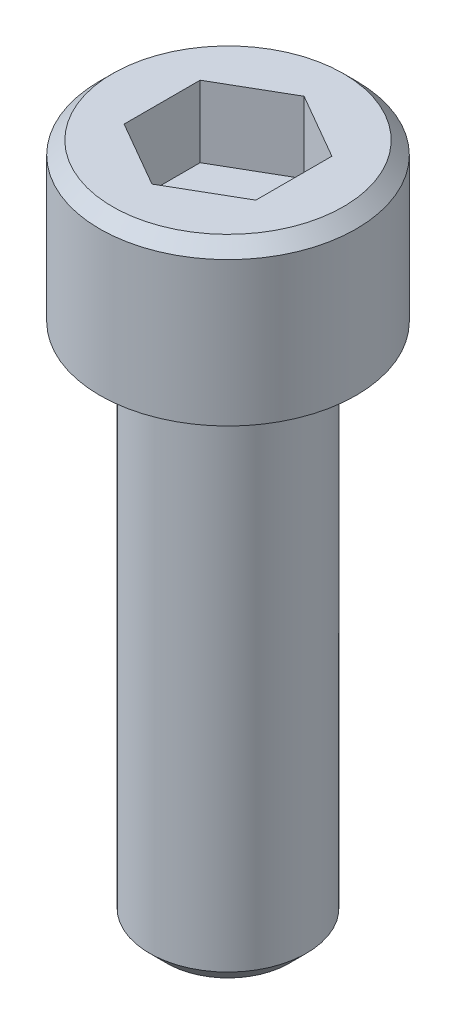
ISO-10303-21;
HEADER;
FILE_DESCRIPTION(('STEP AP214'),'2;1');
FILE_NAME('part.step','',(''),(''),'','','');
FILE_SCHEMA(('AUTOMOTIVE_DESIGN { 1 0 10303 214 1 1 1 1 }'));
ENDSEC;
DATA;
#1=APPLICATION_CONTEXT('core data for automotive mechanical design processes');
#2=APPLICATION_PROTOCOL_DEFINITION('international standard','automotive_design',2000,#1);
#3=PRODUCT_CONTEXT('',#1,'mechanical');
#4=PRODUCT('Part','Part','',(#3));
#5=PRODUCT_RELATED_PRODUCT_CATEGORY('part','',(#4));
#6=PRODUCT_DEFINITION_FORMATION('','',#4);
#7=PRODUCT_DEFINITION_CONTEXT('part definition',#1,'design');
#8=PRODUCT_DEFINITION('design','',#6,#7);
#9=PRODUCT_DEFINITION_SHAPE('','',#8);
#10=(LENGTH_UNIT() NAMED_UNIT(*) SI_UNIT(.MILLI.,.METRE.));
#11=(NAMED_UNIT(*) PLANE_ANGLE_UNIT() SI_UNIT($,.RADIAN.));
#12=(NAMED_UNIT(*) SI_UNIT($,.STERADIAN.) SOLID_ANGLE_UNIT());
#13=UNCERTAINTY_MEASURE_WITH_UNIT(LENGTH_MEASURE(1.E-05),#10,'distance_accuracy_value','');
#14=(GEOMETRIC_REPRESENTATION_CONTEXT(3) GLOBAL_UNCERTAINTY_ASSIGNED_CONTEXT((#13)) GLOBAL_UNIT_ASSIGNED_CONTEXT((#10,
#11,#12)) REPRESENTATION_CONTEXT('',''));
#15=CARTESIAN_POINT('',(0.,0.,0.));
#16=DIRECTION('',(0.,0.,1.));
#17=DIRECTION('',(1.,0.,0.));
#18=AXIS2_PLACEMENT_3D('',#15,#16,#17);
#19=CARTESIAN_POINT('',(1.11022302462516E-13,5.55111512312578E-13,-3.67761376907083E-13));
#20=DIRECTION('',(0.,-1.00000000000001,0.));
#21=DIRECTION('',(0.,0.,-1.00000000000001));
#22=AXIS2_PLACEMENT_3D('',#19,#20,#21);
#23=PLANE('',#22);
#24=CARTESIAN_POINT('',(1.11022302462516E-13,5.55111512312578E-13,-3.67761376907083E-13));
#25=DIRECTION('',(0.,-1.00000000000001,0.));
#26=DIRECTION('',(0.,0.,-1.00000000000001));
#27=AXIS2_PLACEMENT_3D('',#24,#25,#26);
#28=CIRCLE('',#27,1.4224);
#29=CARTESIAN_POINT('',(0.,5.5956282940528E-13,-1.42240000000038));
#30=VERTEX_POINT('',#29);
#31=EDGE_CURVE('E11',#30,#30,#28,.T.);
#32=ORIENTED_EDGE('',*,*,#31,.F.);
#33=EDGE_LOOP('',(#32));
#34=FACE_BOUND('',#33,.T.);
#35=CARTESIAN_POINT('',(1.11022302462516E-13,5.55111512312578E-13,-3.67761376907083E-13));
#36=DIRECTION('',(0.,-1.00000000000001,0.));
#37=DIRECTION('',(0.,0.,-1.00000000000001));
#38=AXIS2_PLACEMENT_3D('',#35,#36,#37);
#39=CIRCLE('',#38,2.3241);
#40=CARTESIAN_POINT('',(0.,5.62384646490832E-13,-2.32410000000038));
#41=VERTEX_POINT('',#40);
#42=EDGE_CURVE('E39',#41,#41,#39,.T.);
#43=ORIENTED_EDGE('',*,*,#42,.T.);
#44=EDGE_LOOP('',(#43));
#45=FACE_BOUND('',#44,.T.);
#46=ADVANCED_FACE('F32',(#34,#45),#23,.T.);
#47=CARTESIAN_POINT('',(1.11022302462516E-13,5.55111512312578E-13,-3.67761376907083E-13));
#48=DIRECTION('',(0.,-1.00000000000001,0.));
#49=DIRECTION('',(0.,0.,-1.00000000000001));
#50=AXIS2_PLACEMENT_3D('',#47,#48,#49);
#51=CYLINDRICAL_SURFACE('',#50,2.3241);
#52=CARTESIAN_POINT('',(2.22044604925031E-13,2.61238999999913,-1.66533453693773E-13));
#53=DIRECTION('',(0.,-1.00000000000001,0.));
#54=DIRECTION('',(0.,0.,-1.00000000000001));
#55=AXIS2_PLACEMENT_3D('',#52,#53,#54);
#56=CIRCLE('',#55,2.3241);
#57=CARTESIAN_POINT('',(1.99789781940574E-13,2.61238999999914,-2.32410000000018));
#58=VERTEX_POINT('',#57);
#59=EDGE_CURVE('E149',#58,#58,#56,.T.);
#60=ORIENTED_EDGE('',*,*,#59,.T.);
#61=EDGE_LOOP('',(#60));
#62=FACE_BOUND('',#61,.T.);
#63=ORIENTED_EDGE('',*,*,#42,.F.);
#64=EDGE_LOOP('',(#63));
#65=FACE_BOUND('',#64,.T.);
#66=ADVANCED_FACE('F155',(#62,#65),#51,.T.);
#67=CARTESIAN_POINT('',(2.22044604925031E-13,2.61238999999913,-1.66533453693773E-13));
#68=DIRECTION('',(0.,-1.00000000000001,0.));
#69=DIRECTION('',(0.,0.,-1.00000000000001));
#70=AXIS2_PLACEMENT_3D('',#67,#68,#69);
#71=CONICAL_SURFACE('',#70,2.3241,0.785398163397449);
#72=CARTESIAN_POINT('',(2.22044604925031E-13,2.84480000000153,-3.05311331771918E-13));
#73=DIRECTION('',(0.,-1.00000000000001,0.));
#74=DIRECTION('',(0.,0.,-1.00000000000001));
#75=AXIS2_PLACEMENT_3D('',#72,#73,#74);
#76=CIRCLE('',#75,2.09169);
#77=CARTESIAN_POINT('',(2.02015264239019E-13,2.84480000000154,-2.09169000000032));
#78=VERTEX_POINT('',#77);
#79=EDGE_CURVE('E146',#78,#78,#76,.T.);
#80=ORIENTED_EDGE('',*,*,#79,.T.);
#81=EDGE_LOOP('',(#80));
#82=FACE_BOUND('',#81,.T.);
#83=ORIENTED_EDGE('',*,*,#59,.F.);
#84=EDGE_LOOP('',(#83));
#85=FACE_BOUND('',#84,.T.);
#86=ADVANCED_FACE('F157',(#82,#85),#71,.T.);
#87=CARTESIAN_POINT('',(2.09169000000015,2.84480000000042,-2.0122792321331E-13));
#88=DIRECTION('',(0.,1.00000000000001,0.));
#89=DIRECTION('',(0.,0.,1.00000000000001));
#90=AXIS2_PLACEMENT_3D('',#87,#88,#89);
#91=PLANE('',#90);
#92=DIRECTION('',(1.02168551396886E-11,0.,1.00000000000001));
#93=VECTOR('',#92,1.);
#94=CARTESIAN_POINT('',(-1.19380000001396,2.84480000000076,-0.689240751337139));
#95=LINE('',#94,#93);
#96=CARTESIAN_POINT('',(-1.19380000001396,2.84480000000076,-0.689240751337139));
#97=VERTEX_POINT('',#96);
#98=CARTESIAN_POINT('',(-1.19379999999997,2.84480000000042,0.689240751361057));
#99=VERTEX_POINT('',#98);
#100=EDGE_CURVE('E46',#97,#99,#95,.T.);
#101=ORIENTED_EDGE('',*,*,#100,.F.);
#102=DIRECTION('',(-0.866025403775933,0.,0.500000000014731));
#103=VECTOR('',#102,1.);
#104=CARTESIAN_POINT('',(-2.09832151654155E-11,2.84480000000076,-1.37848150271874));
#105=LINE('',#104,#103);
#106=CARTESIAN_POINT('',(-2.09832151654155E-11,2.84480000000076,-1.37848150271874));
#107=VERTEX_POINT('',#106);
#108=EDGE_CURVE('E116',#107,#97,#105,.T.);
#109=ORIENTED_EDGE('',*,*,#108,.F.);
#110=DIRECTION('',(-0.866025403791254,0.,-0.499999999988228));
#111=VECTOR('',#110,1.);
#112=CARTESIAN_POINT('',(1.19379999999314,2.84480000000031,-0.689240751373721));
#113=LINE('',#112,#111);
#114=CARTESIAN_POINT('',(1.19379999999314,2.84480000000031,-0.689240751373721));
#115=VERTEX_POINT('',#114);
#116=EDGE_CURVE('E110',#115,#107,#113,.T.);
#117=ORIENTED_EDGE('',*,*,#116,.F.);
#118=DIRECTION('',(-1.02161334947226E-11,0.,-1.00000000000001));
#119=VECTOR('',#118,1.);
#120=CARTESIAN_POINT('',(1.19380000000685,2.84480000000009,0.689240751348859));
#121=LINE('',#120,#119);
#122=CARTESIAN_POINT('',(1.19380000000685,2.84480000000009,0.689240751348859));
#123=VERTEX_POINT('',#122);
#124=EDGE_CURVE('E108',#123,#115,#121,.T.);
#125=ORIENTED_EDGE('',*,*,#124,.F.);
#126=DIRECTION('',(0.866025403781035,0.,-0.500000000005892));
#127=VECTOR('',#126,1.);
#128=CARTESIAN_POINT('',(7.04991620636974E-12,2.84480000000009,1.37848150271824));
#129=LINE('',#128,#127);
#130=CARTESIAN_POINT('',(7.04991620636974E-12,2.84480000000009,1.37848150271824));
#131=VERTEX_POINT('',#130);
#132=EDGE_CURVE('E89',#131,#123,#129,.T.);
#133=ORIENTED_EDGE('',*,*,#132,.F.);
#134=DIRECTION('',(0.866025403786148,0.,0.499999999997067));
#135=VECTOR('',#134,1.);
#136=CARTESIAN_POINT('',(-1.19379999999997,2.84480000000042,0.689240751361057));
#137=LINE('',#136,#135);
#138=EDGE_CURVE('E100',#99,#131,#137,.T.);
#139=ORIENTED_EDGE('',*,*,#138,.F.);
#140=EDGE_LOOP('',(#101,#109,#117,#125,#133,#139));
#141=FACE_BOUND('',#140,.T.);
#142=ORIENTED_EDGE('',*,*,#79,.F.);
#143=EDGE_LOOP('',(#142));
#144=FACE_BOUND('',#143,.T.);
#145=ADVANCED_FACE('F104',(#141,#144),#91,.T.);
#146=CARTESIAN_POINT('',(-2.22044604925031E-13,-9.5249999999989,-1.87350135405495E-13));
#147=DIRECTION('',(0.,-1.00000000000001,0.));
#148=DIRECTION('',(0.,0.,-1.00000000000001));
#149=AXIS2_PLACEMENT_3D('',#146,#147,#148);
#150=PLANE('',#149);
#151=CARTESIAN_POINT('',(-2.22044604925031E-13,-9.5249999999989,-1.87350135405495E-13));
#152=DIRECTION('',(0.,-1.00000000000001,0.));
#153=DIRECTION('',(0.,0.,-1.00000000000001));
#154=AXIS2_PLACEMENT_3D('',#151,#152,#153);
#155=CIRCLE('',#154,1.10617);
#156=CARTESIAN_POINT('',(-2.32636927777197E-13,-9.52499999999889,-1.10617000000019));
#157=VERTEX_POINT('',#156);
#158=EDGE_CURVE('E143',#157,#157,#155,.T.);
#159=ORIENTED_EDGE('',*,*,#158,.T.);
#160=EDGE_LOOP('',(#159));
#161=FACE_BOUND('',#160,.T.);
#162=ADVANCED_FACE('F169',(#161),#150,.T.);
#163=CARTESIAN_POINT('',(-2.22044604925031E-13,-9.5249999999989,-1.87350135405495E-13));
#164=DIRECTION('',(0.,1.00000000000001,0.));
#165=DIRECTION('',(0.,0.,1.00000000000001));
#166=AXIS2_PLACEMENT_3D('',#163,#164,#165);
#167=CONICAL_SURFACE('',#166,1.10617,0.78539816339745);
#168=CARTESIAN_POINT('',(0.,-9.20876999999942,0.));
#169=DIRECTION('',(0.,-1.00000000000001,0.));
#170=DIRECTION('',(0.,0.,-1.00000000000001));
#171=AXIS2_PLACEMENT_3D('',#168,#169,#170);
#172=CIRCLE('',#171,1.4224);
#173=CARTESIAN_POINT('',(0.,-9.20876999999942,-1.42240000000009));
#174=VERTEX_POINT('',#173);
#175=EDGE_CURVE('E134',#174,#174,#172,.T.);
#176=ORIENTED_EDGE('',*,*,#175,.T.);
#177=EDGE_LOOP('',(#176));
#178=FACE_BOUND('',#177,.T.);
#179=ORIENTED_EDGE('',*,*,#158,.F.);
#180=EDGE_LOOP('',(#179));
#181=FACE_BOUND('',#180,.T.);
#182=ADVANCED_FACE('F172',(#178,#181),#167,.T.);
#183=CARTESIAN_POINT('',(1.11022302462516E-13,5.55111512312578E-13,-3.67761376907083E-13));
#184=DIRECTION('',(0.,-1.00000000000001,0.));
#185=DIRECTION('',(0.,0.,-1.00000000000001));
#186=AXIS2_PLACEMENT_3D('',#183,#184,#185);
#187=CYLINDRICAL_SURFACE('',#186,1.4224);
#188=ORIENTED_EDGE('',*,*,#31,.T.);
#189=EDGE_LOOP('',(#188));
#190=FACE_BOUND('',#189,.T.);
#191=ORIENTED_EDGE('',*,*,#175,.F.);
#192=EDGE_LOOP('',(#191));
#193=FACE_BOUND('',#192,.T.);
#194=ADVANCED_FACE('F176',(#190,#193),#187,.T.);
#195=CARTESIAN_POINT('',(-1.19380000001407,1.54940000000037,-0.689240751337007));
#196=DIRECTION('',(-1.,0.,1.01978148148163E-11));
#197=DIRECTION('',(1.02168551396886E-11,0.,1.00000000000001));
#198=AXIS2_PLACEMENT_3D('',#195,#196,#197);
#199=PLANE('',#198);
#200=ORIENTED_EDGE('',*,*,#100,.T.);
#201=DIRECTION('',(0.,1.00000000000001,0.));
#202=VECTOR('',#201,1.);
#203=CARTESIAN_POINT('',(-1.19379999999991,1.54939999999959,0.689240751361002));
#204=LINE('',#203,#202);
#205=CARTESIAN_POINT('',(-1.19379999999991,1.54939999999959,0.689240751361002));
#206=VERTEX_POINT('',#205);
#207=EDGE_CURVE('E97',#206,#99,#204,.T.);
#208=ORIENTED_EDGE('',*,*,#207,.F.);
#209=DIRECTION('',(1.02168551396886E-11,0.,1.00000000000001));
#210=VECTOR('',#209,1.);
#211=CARTESIAN_POINT('',(-1.19380000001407,1.54940000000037,-0.689240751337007));
#212=LINE('',#211,#210);
#213=CARTESIAN_POINT('',(-1.19380000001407,1.54940000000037,-0.689240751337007));
#214=VERTEX_POINT('',#213);
#215=EDGE_CURVE('E118',#214,#206,#212,.T.);
#216=ORIENTED_EDGE('',*,*,#215,.F.);
#217=DIRECTION('',(0.,1.00000000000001,0.));
#218=VECTOR('',#217,1.);
#219=CARTESIAN_POINT('',(-1.19380000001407,1.54940000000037,-0.689240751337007));
#220=LINE('',#219,#218);
#221=EDGE_CURVE('E53',#214,#97,#220,.T.);
#222=ORIENTED_EDGE('',*,*,#221,.T.);
#223=EDGE_LOOP('',(#200,#208,#216,#222));
#224=FACE_BOUND('',#223,.T.);
#225=ADVANCED_FACE('F180',(#224),#199,.F.);
#226=CARTESIAN_POINT('',(-2.11497486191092E-11,1.54940000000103,-1.37848150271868));
#227=DIRECTION('',(-0.500000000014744,0.,-0.866025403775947));
#228=DIRECTION('',(-0.866025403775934,0.,0.500000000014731));
#229=AXIS2_PLACEMENT_3D('',#226,#227,#228);
#230=PLANE('',#229);
#231=ORIENTED_EDGE('',*,*,#108,.T.);
#232=ORIENTED_EDGE('',*,*,#221,.F.);
#233=DIRECTION('',(-0.866025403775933,0.,0.500000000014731));
#234=VECTOR('',#233,1.);
#235=CARTESIAN_POINT('',(-2.11497486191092E-11,1.54940000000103,-1.37848150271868));
#236=LINE('',#235,#234);
#237=CARTESIAN_POINT('',(-2.11497486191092E-11,1.54940000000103,-1.37848150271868));
#238=VERTEX_POINT('',#237);
#239=EDGE_CURVE('E130',#238,#214,#236,.T.);
#240=ORIENTED_EDGE('',*,*,#239,.F.);
#241=DIRECTION('',(0.,1.00000000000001,0.));
#242=VECTOR('',#241,1.);
#243=CARTESIAN_POINT('',(-2.11497486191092E-11,1.54940000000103,-1.37848150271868));
#244=LINE('',#243,#242);
#245=EDGE_CURVE('E135',#238,#107,#244,.T.);
#246=ORIENTED_EDGE('',*,*,#245,.T.);
#247=EDGE_LOOP('',(#231,#232,#240,#246));
#248=FACE_BOUND('',#247,.T.);
#249=ADVANCED_FACE('F184',(#248),#230,.F.);
#250=CARTESIAN_POINT('',(1.19379999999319,1.54940000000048,-0.689240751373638));
#251=DIRECTION('',(0.499999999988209,0.,-0.866025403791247));
#252=DIRECTION('',(-0.866025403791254,0.,-0.499999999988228));
#253=AXIS2_PLACEMENT_3D('',#250,#251,#252);
#254=PLANE('',#253);
#255=ORIENTED_EDGE('',*,*,#116,.T.);
#256=ORIENTED_EDGE('',*,*,#245,.F.);
#257=DIRECTION('',(-0.866025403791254,0.,-0.499999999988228));
#258=VECTOR('',#257,1.);
#259=CARTESIAN_POINT('',(1.19379999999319,1.54940000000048,-0.689240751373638));
#260=LINE('',#259,#258);
#261=CARTESIAN_POINT('',(1.19379999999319,1.54940000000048,-0.689240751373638));
#262=VERTEX_POINT('',#261);
#263=EDGE_CURVE('E127',#262,#238,#260,.T.);
#264=ORIENTED_EDGE('',*,*,#263,.F.);
#265=DIRECTION('',(0.,1.00000000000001,0.));
#266=VECTOR('',#265,1.);
#267=CARTESIAN_POINT('',(1.19379999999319,1.54940000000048,-0.689240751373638));
#268=LINE('',#267,#266);
#269=EDGE_CURVE('E137',#262,#115,#268,.T.);
#270=ORIENTED_EDGE('',*,*,#269,.T.);
#271=EDGE_LOOP('',(#255,#256,#264,#270));
#272=FACE_BOUND('',#271,.T.);
#273=ADVANCED_FACE('F193',(#272),#254,.F.);
#274=CARTESIAN_POINT('',(1.19380000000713,1.54939999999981,0.689240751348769));
#275=DIRECTION('',(1.,0.,-1.01961217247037E-11));
#276=DIRECTION('',(-1.02161334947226E-11,0.,-1.00000000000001));
#277=AXIS2_PLACEMENT_3D('',#274,#275,#276);
#278=PLANE('',#277);
#279=ORIENTED_EDGE('',*,*,#124,.T.);
#280=ORIENTED_EDGE('',*,*,#269,.F.);
#281=DIRECTION('',(-1.02161334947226E-11,0.,-1.00000000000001));
#282=VECTOR('',#281,1.);
#283=CARTESIAN_POINT('',(1.19380000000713,1.54939999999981,0.689240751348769));
#284=LINE('',#283,#282);
#285=CARTESIAN_POINT('',(1.19380000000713,1.54939999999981,0.689240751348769));
#286=VERTEX_POINT('',#285);
#287=EDGE_CURVE('E124',#286,#262,#284,.T.);
#288=ORIENTED_EDGE('',*,*,#287,.F.);
#289=DIRECTION('',(0.,1.00000000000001,0.));
#290=VECTOR('',#289,1.);
#291=CARTESIAN_POINT('',(1.19380000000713,1.54939999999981,0.689240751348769));
#292=LINE('',#291,#290);
#293=EDGE_CURVE('E96',#286,#123,#292,.T.);
#294=ORIENTED_EDGE('',*,*,#293,.T.);
#295=EDGE_LOOP('',(#279,#280,#288,#294));
#296=FACE_BOUND('',#295,.T.);
#297=ADVANCED_FACE('F190',(#296),#278,.F.);
#298=CARTESIAN_POINT('',(7.105427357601E-12,1.54940000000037,1.37848150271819));
#299=DIRECTION('',(0.500000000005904,0.,0.866025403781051));
#300=DIRECTION('',(0.866025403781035,0.,-0.500000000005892));
#301=AXIS2_PLACEMENT_3D('',#298,#299,#300);
#302=PLANE('',#301);
#303=ORIENTED_EDGE('',*,*,#132,.T.);
#304=ORIENTED_EDGE('',*,*,#293,.F.);
#305=DIRECTION('',(0.866025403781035,0.,-0.500000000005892));
#306=VECTOR('',#305,1.);
#307=CARTESIAN_POINT('',(7.105427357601E-12,1.54940000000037,1.37848150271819));
#308=LINE('',#307,#306);
#309=CARTESIAN_POINT('',(7.105427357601E-12,1.54940000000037,1.37848150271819));
#310=VERTEX_POINT('',#309);
#311=EDGE_CURVE('E92',#310,#286,#308,.T.);
#312=ORIENTED_EDGE('',*,*,#311,.F.);
#313=DIRECTION('',(0.,1.00000000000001,0.));
#314=VECTOR('',#313,1.);
#315=CARTESIAN_POINT('',(7.105427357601E-12,1.54940000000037,1.37848150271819));
#316=LINE('',#315,#314);
#317=EDGE_CURVE('E85',#310,#131,#316,.T.);
#318=ORIENTED_EDGE('',*,*,#317,.T.);
#319=EDGE_LOOP('',(#303,#304,#312,#318));
#320=FACE_BOUND('',#319,.T.);
#321=ADVANCED_FACE('F87',(#320),#302,.F.);
#322=CARTESIAN_POINT('',(-1.19379999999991,1.54939999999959,0.689240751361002));
#323=DIRECTION('',(-0.499999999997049,0.,0.866025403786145));
#324=DIRECTION('',(0.866025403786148,0.,0.499999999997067));
#325=AXIS2_PLACEMENT_3D('',#322,#323,#324);
#326=PLANE('',#325);
#327=ORIENTED_EDGE('',*,*,#138,.T.);
#328=ORIENTED_EDGE('',*,*,#317,.F.);
#329=DIRECTION('',(0.866025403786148,0.,0.499999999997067));
#330=VECTOR('',#329,1.);
#331=CARTESIAN_POINT('',(-1.19379999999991,1.54939999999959,0.689240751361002));
#332=LINE('',#331,#330);
#333=EDGE_CURVE('E121',#206,#310,#332,.T.);
#334=ORIENTED_EDGE('',*,*,#333,.F.);
#335=ORIENTED_EDGE('',*,*,#207,.T.);
#336=EDGE_LOOP('',(#327,#328,#334,#335));
#337=FACE_BOUND('',#336,.T.);
#338=ADVANCED_FACE('F101',(#337),#326,.F.);
#339=CARTESIAN_POINT('',(-1.19380000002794,1.54940000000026,-2.06772225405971));
#340=DIRECTION('',(0.,-1.00000000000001,0.));
#341=DIRECTION('',(0.,0.,-1.00000000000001));
#342=AXIS2_PLACEMENT_3D('',#339,#340,#341);
#343=PLANE('',#342);
#344=ORIENTED_EDGE('',*,*,#215,.T.);
#345=ORIENTED_EDGE('',*,*,#333,.T.);
#346=ORIENTED_EDGE('',*,*,#311,.T.);
#347=ORIENTED_EDGE('',*,*,#287,.T.);
#348=ORIENTED_EDGE('',*,*,#263,.T.);
#349=ORIENTED_EDGE('',*,*,#239,.T.);
#350=EDGE_LOOP('',(#344,#345,#346,#347,#348,#349));
#351=FACE_BOUND('',#350,.T.);
#352=ADVANCED_FACE('F187',(#351),#343,.F.);
#353=CLOSED_SHELL('',(#46,#66,#86,#145,#162,#182,#194,#225,#249,#273,#297,#321,#338,#352));
#354=MANIFOLD_SOLID_BREP('B2',#353);
#355=ADVANCED_BREP_SHAPE_REPRESENTATION('',(#18,#354),#14);
#356=SHAPE_DEFINITION_REPRESENTATION(#9,#355);
ENDSEC;
END-ISO-10303-21;
